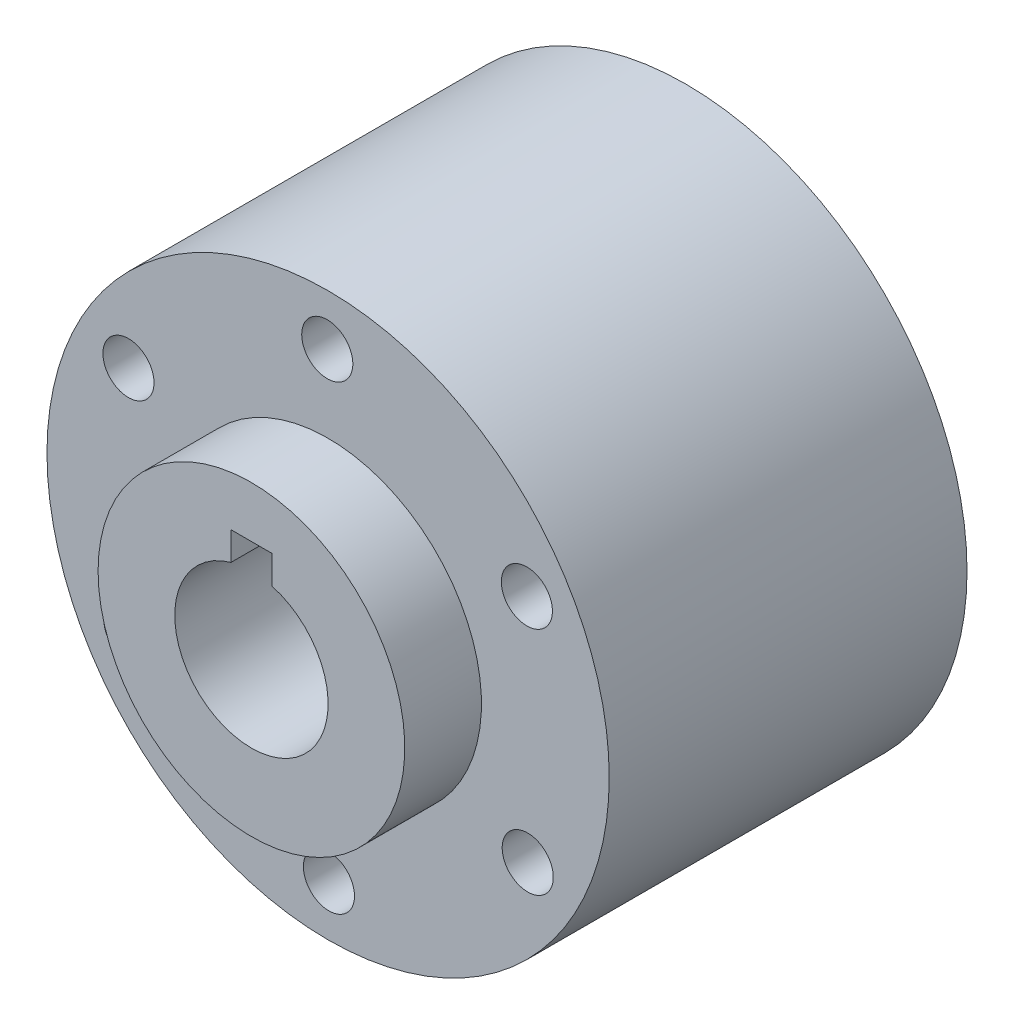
ISO-10303-21;
HEADER;
FILE_DESCRIPTION(('STEP AP214'),'2;1');
FILE_NAME('part.step','',(''),(''),'','','');
FILE_SCHEMA(('AUTOMOTIVE_DESIGN { 1 0 10303 214 1 1 1 1 }'));
ENDSEC;
DATA;
#1=APPLICATION_CONTEXT('core data for automotive mechanical design processes');
#2=APPLICATION_PROTOCOL_DEFINITION('international standard','automotive_design',2000,#1);
#3=PRODUCT_CONTEXT('',#1,'mechanical');
#4=PRODUCT('Part','Part','',(#3));
#5=PRODUCT_RELATED_PRODUCT_CATEGORY('part','',(#4));
#6=PRODUCT_DEFINITION_FORMATION('','',#4);
#7=PRODUCT_DEFINITION_CONTEXT('part definition',#1,'design');
#8=PRODUCT_DEFINITION('design','',#6,#7);
#9=PRODUCT_DEFINITION_SHAPE('','',#8);
#10=(LENGTH_UNIT() NAMED_UNIT(*) SI_UNIT(.MILLI.,.METRE.));
#11=(NAMED_UNIT(*) PLANE_ANGLE_UNIT() SI_UNIT($,.RADIAN.));
#12=(NAMED_UNIT(*) SI_UNIT($,.STERADIAN.) SOLID_ANGLE_UNIT());
#13=UNCERTAINTY_MEASURE_WITH_UNIT(LENGTH_MEASURE(1.E-05),#10,'distance_accuracy_value','');
#14=(GEOMETRIC_REPRESENTATION_CONTEXT(3) GLOBAL_UNCERTAINTY_ASSIGNED_CONTEXT((#13)) GLOBAL_UNIT_ASSIGNED_CONTEXT((#10,
#11,#12)) REPRESENTATION_CONTEXT('',''));
#15=CARTESIAN_POINT('',(0.,0.,0.));
#16=DIRECTION('',(0.,0.,1.));
#17=DIRECTION('',(1.,0.,0.));
#18=AXIS2_PLACEMENT_3D('',#15,#16,#17);
#19=CARTESIAN_POINT('',(40.5005270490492,21.14568854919,40.));
#20=DIRECTION('',(0.,0.,1.));
#21=DIRECTION('',(1.,0.,0.));
#22=AXIS2_PLACEMENT_3D('',#19,#20,#21);
#23=CONICAL_SURFACE('',#22,5.00000000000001,1.02974425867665);
#24=CARTESIAN_POINT('',(40.5005270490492,21.14568854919,40.));
#25=DIRECTION('',(0.,0.,1.));
#26=DIRECTION('',(1.,0.,0.));
#27=AXIS2_PLACEMENT_3D('',#24,#25,#26);
#28=CIRCLE('',#27,5.);
#29=CARTESIAN_POINT('',(45.5005270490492,21.14568854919,40.));
#30=VERTEX_POINT('',#29);
#31=EDGE_CURVE('E117',#30,#30,#28,.T.);
#32=ORIENTED_EDGE('',*,*,#31,.T.);
#33=EDGE_LOOP('',(#32));
#34=FACE_BOUND('',#33,.T.);
#35=CARTESIAN_POINT('',(40.5005270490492,21.14568854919,36.9956969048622));
#36=VERTEX_POINT('',#35);
#37=VERTEX_LOOP('',#36);
#38=FACE_BOUND('',#37,.T.);
#39=ADVANCED_FACE('F16',(#34,#38),#23,.F.);
#40=CARTESIAN_POINT('',(40.6672235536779,-23.8543114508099,40.));
#41=DIRECTION('',(0.,0.,1.));
#42=DIRECTION('',(0.,-1.,0.));
#43=AXIS2_PLACEMENT_3D('',#40,#41,#42);
#44=CONICAL_SURFACE('',#43,4.99999999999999,1.02974425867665);
#45=CARTESIAN_POINT('',(40.6672235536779,-23.8543114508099,40.));
#46=DIRECTION('',(0.,0.,1.));
#47=DIRECTION('',(0.,-1.,0.));
#48=AXIS2_PLACEMENT_3D('',#45,#46,#47);
#49=CIRCLE('',#48,4.99999999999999);
#50=CARTESIAN_POINT('',(40.6672235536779,-28.8543114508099,40.));
#51=VERTEX_POINT('',#50);
#52=EDGE_CURVE('E114',#51,#51,#49,.T.);
#53=ORIENTED_EDGE('',*,*,#52,.T.);
#54=EDGE_LOOP('',(#53));
#55=FACE_BOUND('',#54,.T.);
#56=CARTESIAN_POINT('',(40.6672235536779,-23.8543114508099,36.9956969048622));
#57=VERTEX_POINT('',#56);
#58=VERTEX_LOOP('',#57);
#59=FACE_BOUND('',#58,.T.);
#60=ADVANCED_FACE('F185',(#55,#59),#44,.F.);
#61=CARTESIAN_POINT('',(1.77942863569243,-46.4986748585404,40.));
#62=DIRECTION('',(0.,0.,1.));
#63=DIRECTION('',(0.,-1.,0.));
#64=AXIS2_PLACEMENT_3D('',#61,#62,#63);
#65=CONICAL_SURFACE('',#64,5.,1.02974425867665);
#66=CARTESIAN_POINT('',(1.77942863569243,-46.4986748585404,40.));
#67=DIRECTION('',(0.,0.,1.));
#68=DIRECTION('',(0.,-1.,0.));
#69=AXIS2_PLACEMENT_3D('',#66,#67,#68);
#70=CIRCLE('',#69,5.);
#71=CARTESIAN_POINT('',(1.77942863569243,-51.4986748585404,40.));
#72=VERTEX_POINT('',#71);
#73=EDGE_CURVE('E111',#72,#72,#70,.T.);
#74=ORIENTED_EDGE('',*,*,#73,.T.);
#75=EDGE_LOOP('',(#74));
#76=FACE_BOUND('',#75,.T.);
#77=CARTESIAN_POINT('',(1.77942863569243,-46.4986748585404,36.9956969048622));
#78=VERTEX_POINT('',#77);
#79=VERTEX_LOOP('',#78);
#80=FACE_BOUND('',#79,.T.);
#81=ADVANCED_FACE('F189',(#76,#80),#65,.F.);
#82=CARTESIAN_POINT('',(-37.2750627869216,-24.1430382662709,40.));
#83=DIRECTION('',(0.,0.,1.));
#84=DIRECTION('',(1.,0.,0.));
#85=AXIS2_PLACEMENT_3D('',#82,#83,#84);
#86=CONICAL_SURFACE('',#85,5.,1.02974425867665);
#87=CARTESIAN_POINT('',(-37.2750627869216,-24.1430382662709,40.));
#88=DIRECTION('',(0.,0.,1.));
#89=DIRECTION('',(1.,0.,0.));
#90=AXIS2_PLACEMENT_3D('',#87,#88,#89);
#91=CIRCLE('',#90,5.00000000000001);
#92=CARTESIAN_POINT('',(-32.2750627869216,-24.1430382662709,40.));
#93=VERTEX_POINT('',#92);
#94=EDGE_CURVE('E108',#93,#93,#91,.T.);
#95=ORIENTED_EDGE('',*,*,#94,.T.);
#96=EDGE_LOOP('',(#95));
#97=FACE_BOUND('',#96,.T.);
#98=CARTESIAN_POINT('',(-37.2750627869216,-24.1430382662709,36.9956969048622));
#99=VERTEX_POINT('',#98);
#100=VERTEX_LOOP('',#99);
#101=FACE_BOUND('',#100,.T.);
#102=ADVANCED_FACE('F193',(#97,#101),#86,.F.);
#103=CARTESIAN_POINT('',(-37.4417592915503,20.8569617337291,40.));
#104=DIRECTION('',(0.,0.,1.));
#105=DIRECTION('',(0.,-1.,0.));
#106=AXIS2_PLACEMENT_3D('',#103,#104,#105);
#107=CONICAL_SURFACE('',#106,4.99999999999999,1.02974425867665);
#108=CARTESIAN_POINT('',(-37.4417592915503,20.8569617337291,40.));
#109=DIRECTION('',(0.,0.,1.));
#110=DIRECTION('',(0.,-1.,0.));
#111=AXIS2_PLACEMENT_3D('',#108,#109,#110);
#112=CIRCLE('',#111,5.);
#113=CARTESIAN_POINT('',(-37.4417592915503,15.8569617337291,40.));
#114=VERTEX_POINT('',#113);
#115=EDGE_CURVE('E105',#114,#114,#112,.T.);
#116=ORIENTED_EDGE('',*,*,#115,.T.);
#117=EDGE_LOOP('',(#116));
#118=FACE_BOUND('',#117,.T.);
#119=CARTESIAN_POINT('',(-37.4417592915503,20.8569617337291,36.9956969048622));
#120=VERTEX_POINT('',#119);
#121=VERTEX_LOOP('',#120);
#122=FACE_BOUND('',#121,.T.);
#123=ADVANCED_FACE('F167',(#118,#122),#107,.F.);
#124=CARTESIAN_POINT('',(1.44603562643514,43.5013251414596,40.));
#125=DIRECTION('',(0.,0.,1.));
#126=DIRECTION('',(1.,0.,0.));
#127=AXIS2_PLACEMENT_3D('',#124,#125,#126);
#128=CONICAL_SURFACE('',#127,5.,1.02974425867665);
#129=CARTESIAN_POINT('',(1.44603562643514,43.5013251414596,40.));
#130=DIRECTION('',(0.,0.,1.));
#131=DIRECTION('',(0.,-1.,0.));
#132=AXIS2_PLACEMENT_3D('',#129,#130,#131);
#133=CIRCLE('',#132,5.);
#134=CARTESIAN_POINT('',(1.44603562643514,38.5013251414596,40.));
#135=VERTEX_POINT('',#134);
#136=EDGE_CURVE('E101',#135,#135,#133,.T.);
#137=ORIENTED_EDGE('',*,*,#136,.T.);
#138=EDGE_LOOP('',(#137));
#139=FACE_BOUND('',#138,.T.);
#140=CARTESIAN_POINT('',(1.44603562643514,43.5013251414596,36.9956969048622));
#141=VERTEX_POINT('',#140);
#142=VERTEX_LOOP('',#141);
#143=FACE_BOUND('',#142,.T.);
#144=ADVANCED_FACE('F160',(#139,#143),#128,.F.);
#145=CARTESIAN_POINT('',(1.61273213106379,-1.49867485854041,85.));
#146=DIRECTION('',(0.,0.,-1.));
#147=DIRECTION('',(-1.,0.,0.));
#148=AXIS2_PLACEMENT_3D('',#145,#146,#147);
#149=PLANE('',#148);
#150=CARTESIAN_POINT('',(1.61273213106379,-1.49867485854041,85.));
#151=DIRECTION('',(0.,0.,1.));
#152=DIRECTION('',(1.,0.,0.));
#153=AXIS2_PLACEMENT_3D('',#150,#151,#152);
#154=CIRCLE('',#153,15.);
#155=CARTESIAN_POINT('',(5.61273213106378,12.9581574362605,85.));
#156=VERTEX_POINT('',#155);
#157=CARTESIAN_POINT('',(-2.38726786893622,12.9581574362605,85.));
#158=VERTEX_POINT('',#157);
#159=EDGE_CURVE('E20',#156,#158,#154,.F.);
#160=ORIENTED_EDGE('',*,*,#159,.T.);
#161=DIRECTION('',(0.,1.,0.));
#162=VECTOR('',#161,1.);
#163=CARTESIAN_POINT('',(-2.38726786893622,12.9581574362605,85.));
#164=LINE('',#163,#162);
#165=CARTESIAN_POINT('',(-2.38726786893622,18.5013251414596,85.));
#166=VERTEX_POINT('',#165);
#167=EDGE_CURVE('E120',#158,#166,#164,.T.);
#168=ORIENTED_EDGE('',*,*,#167,.T.);
#169=DIRECTION('',(1.,0.,0.));
#170=VECTOR('',#169,1.);
#171=CARTESIAN_POINT('',(-2.38726786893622,18.5013251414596,85.));
#172=LINE('',#171,#170);
#173=CARTESIAN_POINT('',(5.61273213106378,18.5013251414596,85.));
#174=VERTEX_POINT('',#173);
#175=EDGE_CURVE('E87',#166,#174,#172,.T.);
#176=ORIENTED_EDGE('',*,*,#175,.T.);
#177=DIRECTION('',(0.,1.,0.));
#178=VECTOR('',#177,1.);
#179=CARTESIAN_POINT('',(5.61273213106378,18.5013251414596,85.));
#180=LINE('',#179,#178);
#181=EDGE_CURVE('E84',#174,#156,#180,.F.);
#182=ORIENTED_EDGE('',*,*,#181,.T.);
#183=EDGE_LOOP('',(#160,#168,#176,#182));
#184=FACE_BOUND('',#183,.T.);
#185=CARTESIAN_POINT('',(1.61273213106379,-1.49867485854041,85.));
#186=DIRECTION('',(0.,0.,-1.));
#187=DIRECTION('',(-1.,0.,0.));
#188=AXIS2_PLACEMENT_3D('',#185,#186,#187);
#189=CIRCLE('',#188,30.);
#190=CARTESIAN_POINT('',(-28.3872678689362,-1.49867485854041,85.));
#191=VERTEX_POINT('',#190);
#192=EDGE_CURVE('E104',#191,#191,#189,.T.);
#193=ORIENTED_EDGE('',*,*,#192,.F.);
#194=EDGE_LOOP('',(#193));
#195=FACE_BOUND('',#194,.T.);
#196=ADVANCED_FACE('F85',(#184,#195),#149,.F.);
#197=CARTESIAN_POINT('',(1.61273213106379,-1.49867485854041,0.));
#198=DIRECTION('',(0.,0.,1.));
#199=DIRECTION('',(1.,0.,0.));
#200=AXIS2_PLACEMENT_3D('',#197,#198,#199);
#201=CYLINDRICAL_SURFACE('',#200,15.);
#202=ORIENTED_EDGE('',*,*,#159,.F.);
#203=DIRECTION('',(0.,0.,-1.));
#204=VECTOR('',#203,1.);
#205=CARTESIAN_POINT('',(5.61273213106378,12.9581574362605,0.));
#206=LINE('',#205,#204);
#207=CARTESIAN_POINT('',(5.61273213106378,12.9581574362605,0.));
#208=VERTEX_POINT('',#207);
#209=EDGE_CURVE('E76',#156,#208,#206,.T.);
#210=ORIENTED_EDGE('',*,*,#209,.T.);
#211=CARTESIAN_POINT('',(1.61273213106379,-1.49867485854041,0.));
#212=DIRECTION('',(0.,0.,1.));
#213=DIRECTION('',(1.,0.,0.));
#214=AXIS2_PLACEMENT_3D('',#211,#212,#213);
#215=CIRCLE('',#214,15.);
#216=CARTESIAN_POINT('',(-2.38726786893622,12.9581574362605,0.));
#217=VERTEX_POINT('',#216);
#218=EDGE_CURVE('E153',#217,#208,#215,.T.);
#219=ORIENTED_EDGE('',*,*,#218,.F.);
#220=DIRECTION('',(0.,0.,1.));
#221=VECTOR('',#220,1.);
#222=CARTESIAN_POINT('',(-2.38726786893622,12.9581574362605,0.));
#223=LINE('',#222,#221);
#224=EDGE_CURVE('E79',#217,#158,#223,.T.);
#225=ORIENTED_EDGE('',*,*,#224,.T.);
#226=EDGE_LOOP('',(#202,#210,#219,#225));
#227=FACE_BOUND('',#226,.T.);
#228=ADVANCED_FACE('F74',(#227),#201,.F.);
#229=CARTESIAN_POINT('',(5.61273213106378,18.5013251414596,0.));
#230=DIRECTION('',(1.,0.,0.));
#231=DIRECTION('',(0.,0.,-1.));
#232=AXIS2_PLACEMENT_3D('',#229,#230,#231);
#233=PLANE('',#232);
#234=DIRECTION('',(0.,0.,1.));
#235=VECTOR('',#234,1.);
#236=CARTESIAN_POINT('',(5.61273213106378,18.5013251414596,0.));
#237=LINE('',#236,#235);
#238=CARTESIAN_POINT('',(5.61273213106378,18.5013251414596,0.));
#239=VERTEX_POINT('',#238);
#240=EDGE_CURVE('E90',#174,#239,#237,.F.);
#241=ORIENTED_EDGE('',*,*,#240,.T.);
#242=DIRECTION('',(0.,1.,0.));
#243=VECTOR('',#242,1.);
#244=CARTESIAN_POINT('',(5.61273213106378,-1.49867485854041,0.));
#245=LINE('',#244,#243);
#246=EDGE_CURVE('E94',#208,#239,#245,.T.);
#247=ORIENTED_EDGE('',*,*,#246,.F.);
#248=ORIENTED_EDGE('',*,*,#209,.F.);
#249=ORIENTED_EDGE('',*,*,#181,.F.);
#250=EDGE_LOOP('',(#241,#247,#248,#249));
#251=FACE_BOUND('',#250,.T.);
#252=ADVANCED_FACE('F92',(#251),#233,.F.);
#253=CARTESIAN_POINT('',(-2.38726786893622,18.5013251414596,0.));
#254=DIRECTION('',(0.,1.,0.));
#255=DIRECTION('',(0.,0.,1.));
#256=AXIS2_PLACEMENT_3D('',#253,#254,#255);
#257=PLANE('',#256);
#258=DIRECTION('',(0.,0.,1.));
#259=VECTOR('',#258,1.);
#260=CARTESIAN_POINT('',(-2.38726786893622,18.5013251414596,0.));
#261=LINE('',#260,#259);
#262=CARTESIAN_POINT('',(-2.38726786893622,18.5013251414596,0.));
#263=VERTEX_POINT('',#262);
#264=EDGE_CURVE('E35',#166,#263,#261,.F.);
#265=ORIENTED_EDGE('',*,*,#264,.T.);
#266=DIRECTION('',(-1.,0.,0.));
#267=VECTOR('',#266,1.);
#268=CARTESIAN_POINT('',(1.61273213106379,18.5013251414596,0.));
#269=LINE('',#268,#267);
#270=EDGE_CURVE('E271',#239,#263,#269,.T.);
#271=ORIENTED_EDGE('',*,*,#270,.F.);
#272=ORIENTED_EDGE('',*,*,#240,.F.);
#273=ORIENTED_EDGE('',*,*,#175,.F.);
#274=EDGE_LOOP('',(#265,#271,#272,#273));
#275=FACE_BOUND('',#274,.T.);
#276=ADVANCED_FACE('F256',(#275),#257,.F.);
#277=CARTESIAN_POINT('',(-2.38726786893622,12.9581574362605,0.));
#278=DIRECTION('',(-1.,0.,0.));
#279=DIRECTION('',(0.,0.,1.));
#280=AXIS2_PLACEMENT_3D('',#277,#278,#279);
#281=PLANE('',#280);
#282=ORIENTED_EDGE('',*,*,#224,.F.);
#283=DIRECTION('',(0.,1.,0.));
#284=VECTOR('',#283,1.);
#285=CARTESIAN_POINT('',(-2.38726786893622,-1.49867485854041,0.));
#286=LINE('',#285,#284);
#287=EDGE_CURVE('E152',#263,#217,#286,.F.);
#288=ORIENTED_EDGE('',*,*,#287,.F.);
#289=ORIENTED_EDGE('',*,*,#264,.F.);
#290=ORIENTED_EDGE('',*,*,#167,.F.);
#291=EDGE_LOOP('',(#282,#288,#289,#290));
#292=FACE_BOUND('',#291,.T.);
#293=ADVANCED_FACE('F205',(#292),#281,.F.);
#294=CARTESIAN_POINT('',(40.5005270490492,21.14568854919,70.));
#295=DIRECTION('',(0.,0.,-1.));
#296=DIRECTION('',(-1.,0.,0.));
#297=AXIS2_PLACEMENT_3D('',#294,#295,#296);
#298=CYLINDRICAL_SURFACE('',#297,5.);
#299=ORIENTED_EDGE('',*,*,#31,.F.);
#300=EDGE_LOOP('',(#299));
#301=FACE_BOUND('',#300,.T.);
#302=CARTESIAN_POINT('',(40.5005270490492,21.14568854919,70.));
#303=DIRECTION('',(0.,0.,-1.));
#304=DIRECTION('',(-1.,0.,0.));
#305=AXIS2_PLACEMENT_3D('',#302,#303,#304);
#306=CIRCLE('',#305,5.);
#307=CARTESIAN_POINT('',(35.5005270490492,21.14568854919,70.));
#308=VERTEX_POINT('',#307);
#309=EDGE_CURVE('E149',#308,#308,#306,.F.);
#310=ORIENTED_EDGE('',*,*,#309,.T.);
#311=EDGE_LOOP('',(#310));
#312=FACE_BOUND('',#311,.T.);
#313=ADVANCED_FACE('F201',(#301,#312),#298,.F.);
#314=CARTESIAN_POINT('',(40.6672235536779,-23.8543114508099,70.));
#315=DIRECTION('',(0.,0.,-1.));
#316=DIRECTION('',(-1.,0.,0.));
#317=AXIS2_PLACEMENT_3D('',#314,#315,#316);
#318=CYLINDRICAL_SURFACE('',#317,4.99999999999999);
#319=ORIENTED_EDGE('',*,*,#52,.F.);
#320=EDGE_LOOP('',(#319));
#321=FACE_BOUND('',#320,.T.);
#322=CARTESIAN_POINT('',(40.6672235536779,-23.8543114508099,70.));
#323=DIRECTION('',(0.,0.,-1.));
#324=DIRECTION('',(-1.,0.,0.));
#325=AXIS2_PLACEMENT_3D('',#322,#323,#324);
#326=CIRCLE('',#325,4.99999999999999);
#327=CARTESIAN_POINT('',(35.6672235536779,-23.8543114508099,70.));
#328=VERTEX_POINT('',#327);
#329=EDGE_CURVE('E146',#328,#328,#326,.F.);
#330=ORIENTED_EDGE('',*,*,#329,.T.);
#331=EDGE_LOOP('',(#330));
#332=FACE_BOUND('',#331,.T.);
#333=ADVANCED_FACE('F204',(#321,#332),#318,.F.);
#334=CARTESIAN_POINT('',(1.77942863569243,-46.4986748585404,70.));
#335=DIRECTION('',(0.,0.,-1.));
#336=DIRECTION('',(-1.,0.,0.));
#337=AXIS2_PLACEMENT_3D('',#334,#335,#336);
#338=CYLINDRICAL_SURFACE('',#337,5.);
#339=ORIENTED_EDGE('',*,*,#73,.F.);
#340=EDGE_LOOP('',(#339));
#341=FACE_BOUND('',#340,.T.);
#342=CARTESIAN_POINT('',(1.77942863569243,-46.4986748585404,70.));
#343=DIRECTION('',(0.,0.,-1.));
#344=DIRECTION('',(-1.,0.,0.));
#345=AXIS2_PLACEMENT_3D('',#342,#343,#344);
#346=CIRCLE('',#345,5.);
#347=CARTESIAN_POINT('',(-3.22057136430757,-46.4986748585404,70.));
#348=VERTEX_POINT('',#347);
#349=EDGE_CURVE('E143',#348,#348,#346,.F.);
#350=ORIENTED_EDGE('',*,*,#349,.T.);
#351=EDGE_LOOP('',(#350));
#352=FACE_BOUND('',#351,.T.);
#353=ADVANCED_FACE('F209',(#341,#352),#338,.F.);
#354=CARTESIAN_POINT('',(-37.2750627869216,-24.1430382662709,70.));
#355=DIRECTION('',(0.,0.,-1.));
#356=DIRECTION('',(-1.,0.,0.));
#357=AXIS2_PLACEMENT_3D('',#354,#355,#356);
#358=CYLINDRICAL_SURFACE('',#357,5.00000000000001);
#359=ORIENTED_EDGE('',*,*,#94,.F.);
#360=EDGE_LOOP('',(#359));
#361=FACE_BOUND('',#360,.T.);
#362=CARTESIAN_POINT('',(-37.2750627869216,-24.1430382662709,70.));
#363=DIRECTION('',(0.,0.,-1.));
#364=DIRECTION('',(-1.,0.,0.));
#365=AXIS2_PLACEMENT_3D('',#362,#363,#364);
#366=CIRCLE('',#365,5.00000000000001);
#367=CARTESIAN_POINT('',(-42.2750627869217,-24.1430382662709,70.));
#368=VERTEX_POINT('',#367);
#369=EDGE_CURVE('E140',#368,#368,#366,.F.);
#370=ORIENTED_EDGE('',*,*,#369,.T.);
#371=EDGE_LOOP('',(#370));
#372=FACE_BOUND('',#371,.T.);
#373=ADVANCED_FACE('F213',(#361,#372),#358,.F.);
#374=CARTESIAN_POINT('',(-37.4417592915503,20.8569617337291,70.));
#375=DIRECTION('',(0.,0.,-1.));
#376=DIRECTION('',(-1.,0.,0.));
#377=AXIS2_PLACEMENT_3D('',#374,#375,#376);
#378=CYLINDRICAL_SURFACE('',#377,5.);
#379=ORIENTED_EDGE('',*,*,#115,.F.);
#380=EDGE_LOOP('',(#379));
#381=FACE_BOUND('',#380,.T.);
#382=CARTESIAN_POINT('',(-37.4417592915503,20.8569617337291,70.));
#383=DIRECTION('',(0.,0.,-1.));
#384=DIRECTION('',(-1.,0.,0.));
#385=AXIS2_PLACEMENT_3D('',#382,#383,#384);
#386=CIRCLE('',#385,5.);
#387=CARTESIAN_POINT('',(-42.4417592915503,20.8569617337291,70.));
#388=VERTEX_POINT('',#387);
#389=EDGE_CURVE('E137',#388,#388,#386,.F.);
#390=ORIENTED_EDGE('',*,*,#389,.T.);
#391=EDGE_LOOP('',(#390));
#392=FACE_BOUND('',#391,.T.);
#393=ADVANCED_FACE('F216',(#381,#392),#378,.F.);
#394=CARTESIAN_POINT('',(1.44603562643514,43.5013251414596,70.));
#395=DIRECTION('',(0.,0.,-1.));
#396=DIRECTION('',(-1.,0.,0.));
#397=AXIS2_PLACEMENT_3D('',#394,#395,#396);
#398=CYLINDRICAL_SURFACE('',#397,5.);
#399=ORIENTED_EDGE('',*,*,#136,.F.);
#400=EDGE_LOOP('',(#399));
#401=FACE_BOUND('',#400,.T.);
#402=CARTESIAN_POINT('',(1.44603562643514,43.5013251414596,70.));
#403=DIRECTION('',(0.,0.,-1.));
#404=DIRECTION('',(-1.,0.,0.));
#405=AXIS2_PLACEMENT_3D('',#402,#403,#404);
#406=CIRCLE('',#405,5.);
#407=CARTESIAN_POINT('',(-3.55396437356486,43.5013251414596,70.));
#408=VERTEX_POINT('',#407);
#409=EDGE_CURVE('E134',#408,#408,#406,.F.);
#410=ORIENTED_EDGE('',*,*,#409,.T.);
#411=EDGE_LOOP('',(#410));
#412=FACE_BOUND('',#411,.T.);
#413=ADVANCED_FACE('F18',(#401,#412),#398,.F.);
#414=CARTESIAN_POINT('',(1.61273213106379,-1.49867485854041,85.));
#415=DIRECTION('',(0.,0.,-1.));
#416=DIRECTION('',(-1.,0.,0.));
#417=AXIS2_PLACEMENT_3D('',#414,#415,#416);
#418=CYLINDRICAL_SURFACE('',#417,30.);
#419=ORIENTED_EDGE('',*,*,#192,.T.);
#420=EDGE_LOOP('',(#419));
#421=FACE_BOUND('',#420,.T.);
#422=CARTESIAN_POINT('',(1.61273213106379,-1.49867485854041,70.));
#423=DIRECTION('',(0.,0.,-1.));
#424=DIRECTION('',(-1.,0.,0.));
#425=AXIS2_PLACEMENT_3D('',#422,#423,#424);
#426=CIRCLE('',#425,30.);
#427=CARTESIAN_POINT('',(-28.3872678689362,-1.49867485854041,70.));
#428=VERTEX_POINT('',#427);
#429=EDGE_CURVE('E131',#428,#428,#426,.F.);
#430=ORIENTED_EDGE('',*,*,#429,.T.);
#431=EDGE_LOOP('',(#430));
#432=FACE_BOUND('',#431,.T.);
#433=ADVANCED_FACE('F157',(#421,#432),#418,.T.);
#434=CARTESIAN_POINT('',(1.61273213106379,-1.49867485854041,0.));
#435=DIRECTION('',(0.,0.,-1.));
#436=DIRECTION('',(-1.,0.,0.));
#437=AXIS2_PLACEMENT_3D('',#434,#435,#436);
#438=PLANE('',#437);
#439=ORIENTED_EDGE('',*,*,#270,.T.);
#440=ORIENTED_EDGE('',*,*,#287,.T.);
#441=ORIENTED_EDGE('',*,*,#218,.T.);
#442=ORIENTED_EDGE('',*,*,#246,.T.);
#443=EDGE_LOOP('',(#439,#440,#441,#442));
#444=FACE_BOUND('',#443,.T.);
#445=CARTESIAN_POINT('',(1.61273213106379,-1.49867485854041,0.));
#446=DIRECTION('',(0.,0.,1.));
#447=DIRECTION('',(1.,0.,0.));
#448=AXIS2_PLACEMENT_3D('',#445,#446,#447);
#449=CIRCLE('',#448,55.);
#450=CARTESIAN_POINT('',(56.6127321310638,-1.49867485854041,0.));
#451=VERTEX_POINT('',#450);
#452=EDGE_CURVE('E26',#451,#451,#449,.T.);
#453=ORIENTED_EDGE('',*,*,#452,.F.);
#454=EDGE_LOOP('',(#453));
#455=FACE_BOUND('',#454,.T.);
#456=ADVANCED_FACE('F177',(#444,#455),#438,.T.);
#457=CARTESIAN_POINT('',(1.61273213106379,-1.49867485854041,70.));
#458=DIRECTION('',(0.,0.,-1.));
#459=DIRECTION('',(-1.,0.,0.));
#460=AXIS2_PLACEMENT_3D('',#457,#458,#459);
#461=PLANE('',#460);
#462=ORIENTED_EDGE('',*,*,#429,.F.);
#463=EDGE_LOOP('',(#462));
#464=FACE_BOUND('',#463,.T.);
#465=ORIENTED_EDGE('',*,*,#409,.F.);
#466=EDGE_LOOP('',(#465));
#467=FACE_BOUND('',#466,.T.);
#468=ORIENTED_EDGE('',*,*,#389,.F.);
#469=EDGE_LOOP('',(#468));
#470=FACE_BOUND('',#469,.T.);
#471=ORIENTED_EDGE('',*,*,#369,.F.);
#472=EDGE_LOOP('',(#471));
#473=FACE_BOUND('',#472,.T.);
#474=ORIENTED_EDGE('',*,*,#349,.F.);
#475=EDGE_LOOP('',(#474));
#476=FACE_BOUND('',#475,.T.);
#477=ORIENTED_EDGE('',*,*,#329,.F.);
#478=EDGE_LOOP('',(#477));
#479=FACE_BOUND('',#478,.T.);
#480=ORIENTED_EDGE('',*,*,#309,.F.);
#481=EDGE_LOOP('',(#480));
#482=FACE_BOUND('',#481,.T.);
#483=CARTESIAN_POINT('',(1.61273213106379,-1.49867485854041,70.));
#484=DIRECTION('',(0.,0.,1.));
#485=DIRECTION('',(1.,0.,0.));
#486=AXIS2_PLACEMENT_3D('',#483,#484,#485);
#487=CIRCLE('',#486,55.);
#488=CARTESIAN_POINT('',(56.6127321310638,-1.49867485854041,70.));
#489=VERTEX_POINT('',#488);
#490=EDGE_CURVE('E10',#489,#489,#487,.F.);
#491=ORIENTED_EDGE('',*,*,#490,.F.);
#492=EDGE_LOOP('',(#491));
#493=FACE_BOUND('',#492,.T.);
#494=ADVANCED_FACE('F172',(#464,#467,#470,#473,#476,#479,#482,#493),#461,.F.);
#495=CARTESIAN_POINT('',(1.61273213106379,-1.49867485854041,0.));
#496=DIRECTION('',(0.,0.,1.));
#497=DIRECTION('',(1.,0.,0.));
#498=AXIS2_PLACEMENT_3D('',#495,#496,#497);
#499=CYLINDRICAL_SURFACE('',#498,55.);
#500=ORIENTED_EDGE('',*,*,#452,.T.);
#501=EDGE_LOOP('',(#500));
#502=FACE_BOUND('',#501,.T.);
#503=ORIENTED_EDGE('',*,*,#490,.T.);
#504=EDGE_LOOP('',(#503));
#505=FACE_BOUND('',#504,.T.);
#506=ADVANCED_FACE('F170',(#502,#505),#499,.T.);
#507=CLOSED_SHELL('',(#39,#60,#81,#102,#123,#144,#196,#228,#252,#276,#293,#313,#333,#353,#373,
#393,#413,#433,#456,#494,#506));
#508=MANIFOLD_SOLID_BREP('B1',#507);
#509=ADVANCED_BREP_SHAPE_REPRESENTATION('',(#18,#508),#14);
#510=SHAPE_DEFINITION_REPRESENTATION(#9,#509);
ENDSEC;
END-ISO-10303-21;
